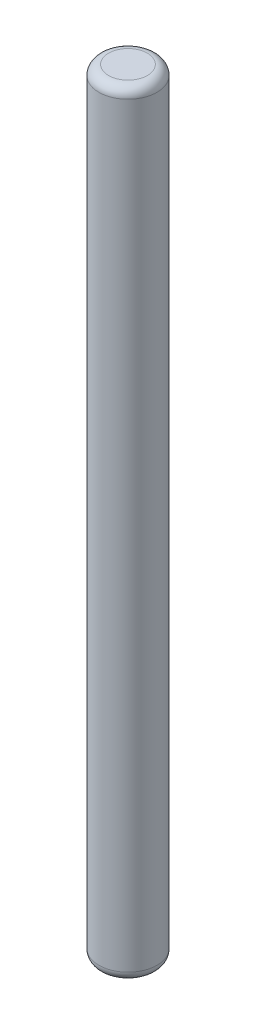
ISO-10303-21;
HEADER;
FILE_DESCRIPTION(('STEP AP214'),'2;1');
FILE_NAME('part.step','',(''),(''),'','','');
FILE_SCHEMA(('AUTOMOTIVE_DESIGN { 1 0 10303 214 1 1 1 1 }'));
ENDSEC;
DATA;
#1=APPLICATION_CONTEXT('core data for automotive mechanical design processes');
#2=APPLICATION_PROTOCOL_DEFINITION('international standard','automotive_design',2000,#1);
#3=PRODUCT_CONTEXT('',#1,'mechanical');
#4=PRODUCT('Part','Part','',(#3));
#5=PRODUCT_RELATED_PRODUCT_CATEGORY('part','',(#4));
#6=PRODUCT_DEFINITION_FORMATION('','',#4);
#7=PRODUCT_DEFINITION_CONTEXT('part definition',#1,'design');
#8=PRODUCT_DEFINITION('design','',#6,#7);
#9=PRODUCT_DEFINITION_SHAPE('','',#8);
#10=(LENGTH_UNIT() NAMED_UNIT(*) SI_UNIT(.MILLI.,.METRE.));
#11=(NAMED_UNIT(*) PLANE_ANGLE_UNIT() SI_UNIT($,.RADIAN.));
#12=(NAMED_UNIT(*) SI_UNIT($,.STERADIAN.) SOLID_ANGLE_UNIT());
#13=UNCERTAINTY_MEASURE_WITH_UNIT(LENGTH_MEASURE(1.E-05),#10,'distance_accuracy_value','');
#14=(GEOMETRIC_REPRESENTATION_CONTEXT(3) GLOBAL_UNCERTAINTY_ASSIGNED_CONTEXT((#13)) GLOBAL_UNIT_ASSIGNED_CONTEXT((#10,
#11,#12)) REPRESENTATION_CONTEXT('',''));
#15=CARTESIAN_POINT('',(0.,0.,0.));
#16=DIRECTION('',(0.,0.,1.));
#17=DIRECTION('',(1.,0.,0.));
#18=AXIS2_PLACEMENT_3D('',#15,#16,#17);
#19=CARTESIAN_POINT('',(0.,10.,0.));
#20=DIRECTION('',(0.,-1.,0.));
#21=DIRECTION('',(0.,0.,-1.));
#22=AXIS2_PLACEMENT_3D('',#19,#20,#21);
#23=CYLINDRICAL_SURFACE('',#22,0.75);
#24=CARTESIAN_POINT('',(0.,-9.75,0.));
#25=DIRECTION('',(0.,1.,0.));
#26=DIRECTION('',(0.,0.,1.));
#27=AXIS2_PLACEMENT_3D('',#24,#25,#26);
#28=CIRCLE('',#27,0.75);
#29=CARTESIAN_POINT('',(0.,-9.75,0.75));
#30=VERTEX_POINT('',#29);
#31=EDGE_CURVE('E40',#30,#30,#28,.T.);
#32=ORIENTED_EDGE('',*,*,#31,.T.);
#33=EDGE_LOOP('',(#32));
#34=FACE_BOUND('',#33,.T.);
#35=CARTESIAN_POINT('',(0.,9.75,0.));
#36=DIRECTION('',(0.,1.,0.));
#37=DIRECTION('',(0.,0.,1.));
#38=AXIS2_PLACEMENT_3D('',#35,#36,#37);
#39=CIRCLE('',#38,0.75);
#40=CARTESIAN_POINT('',(0.,9.75,0.75));
#41=VERTEX_POINT('',#40);
#42=EDGE_CURVE('E44',#41,#41,#39,.F.);
#43=ORIENTED_EDGE('',*,*,#42,.T.);
#44=EDGE_LOOP('',(#43));
#45=FACE_BOUND('',#44,.T.);
#46=ADVANCED_FACE('F29',(#34,#45),#23,.T.);
#47=CARTESIAN_POINT('',(0.,10.,0.));
#48=DIRECTION('',(0.,1.,0.));
#49=DIRECTION('',(0.,0.,1.));
#50=AXIS2_PLACEMENT_3D('',#47,#48,#49);
#51=PLANE('',#50);
#52=CARTESIAN_POINT('',(0.,10.,0.));
#53=DIRECTION('',(0.,1.,0.));
#54=DIRECTION('',(0.,0.,1.));
#55=AXIS2_PLACEMENT_3D('',#52,#53,#54);
#56=CIRCLE('',#55,0.5);
#57=CARTESIAN_POINT('',(0.,10.,0.5));
#58=VERTEX_POINT('',#57);
#59=EDGE_CURVE('E10',#58,#58,#56,.T.);
#60=ORIENTED_EDGE('',*,*,#59,.T.);
#61=EDGE_LOOP('',(#60));
#62=FACE_BOUND('',#61,.T.);
#63=ADVANCED_FACE('F60',(#62),#51,.T.);
#64=CARTESIAN_POINT('',(0.,-10.,0.));
#65=DIRECTION('',(0.,1.,0.));
#66=DIRECTION('',(0.,0.,1.));
#67=AXIS2_PLACEMENT_3D('',#64,#65,#66);
#68=PLANE('',#67);
#69=CARTESIAN_POINT('',(0.,-10.,0.));
#70=DIRECTION('',(0.,1.,0.));
#71=DIRECTION('',(0.,0.,1.));
#72=AXIS2_PLACEMENT_3D('',#69,#70,#71);
#73=CIRCLE('',#72,0.5);
#74=CARTESIAN_POINT('',(0.,-10.,0.5));
#75=VERTEX_POINT('',#74);
#76=EDGE_CURVE('E36',#75,#75,#73,.F.);
#77=ORIENTED_EDGE('',*,*,#76,.T.);
#78=EDGE_LOOP('',(#77));
#79=FACE_BOUND('',#78,.T.);
#80=ADVANCED_FACE('F57',(#79),#68,.F.);
#81=CARTESIAN_POINT('',(0.,-9.75,0.));
#82=DIRECTION('',(0.,1.,0.));
#83=DIRECTION('',(0.,0.,1.));
#84=AXIS2_PLACEMENT_3D('',#81,#82,#83);
#85=TOROIDAL_SURFACE('',#84,0.5,0.25);
#86=ORIENTED_EDGE('',*,*,#76,.F.);
#87=EDGE_LOOP('',(#86));
#88=FACE_BOUND('',#87,.T.);
#89=ORIENTED_EDGE('',*,*,#31,.F.);
#90=EDGE_LOOP('',(#89));
#91=FACE_BOUND('',#90,.T.);
#92=ADVANCED_FACE('F53',(#88,#91),#85,.T.);
#93=CARTESIAN_POINT('',(0.,9.75,0.));
#94=DIRECTION('',(0.,1.,0.));
#95=DIRECTION('',(0.,0.,1.));
#96=AXIS2_PLACEMENT_3D('',#93,#94,#95);
#97=TOROIDAL_SURFACE('',#96,0.5,0.25);
#98=ORIENTED_EDGE('',*,*,#42,.F.);
#99=EDGE_LOOP('',(#98));
#100=FACE_BOUND('',#99,.T.);
#101=ORIENTED_EDGE('',*,*,#59,.F.);
#102=EDGE_LOOP('',(#101));
#103=FACE_BOUND('',#102,.T.);
#104=ADVANCED_FACE('F31',(#100,#103),#97,.T.);
#105=CLOSED_SHELL('',(#46,#63,#80,#92,#104));
#106=MANIFOLD_SOLID_BREP('B2',#105);
#107=ADVANCED_BREP_SHAPE_REPRESENTATION('',(#18,#106),#14);
#108=SHAPE_DEFINITION_REPRESENTATION(#9,#107);
ENDSEC;
END-ISO-10303-21;
